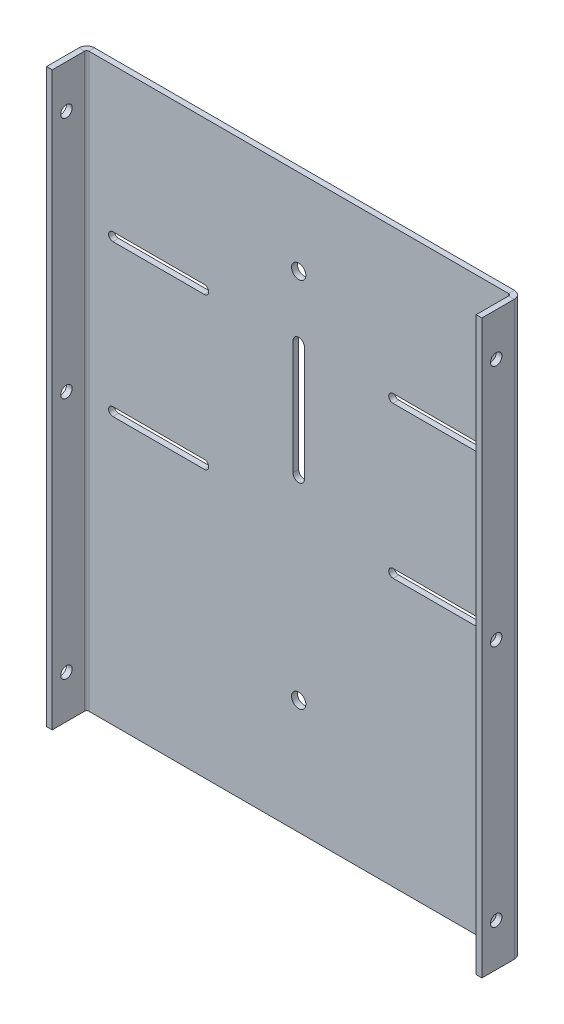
ISO-10303-21;
HEADER;
FILE_DESCRIPTION(('STEP AP214'),'2;1');
FILE_NAME('part.step','',(''),(''),'','','');
FILE_SCHEMA(('AUTOMOTIVE_DESIGN { 1 0 10303 214 1 1 1 1 }'));
ENDSEC;
DATA;
#1=APPLICATION_CONTEXT('core data for automotive mechanical design processes');
#2=APPLICATION_PROTOCOL_DEFINITION('international standard','automotive_design',2000,#1);
#3=PRODUCT_CONTEXT('',#1,'mechanical');
#4=PRODUCT('Part','Part','',(#3));
#5=PRODUCT_RELATED_PRODUCT_CATEGORY('part','',(#4));
#6=PRODUCT_DEFINITION_FORMATION('','',#4);
#7=PRODUCT_DEFINITION_CONTEXT('part definition',#1,'design');
#8=PRODUCT_DEFINITION('design','',#6,#7);
#9=PRODUCT_DEFINITION_SHAPE('','',#8);
#10=(LENGTH_UNIT() NAMED_UNIT(*) SI_UNIT(.MILLI.,.METRE.));
#11=(NAMED_UNIT(*) PLANE_ANGLE_UNIT() SI_UNIT($,.RADIAN.));
#12=(NAMED_UNIT(*) SI_UNIT($,.STERADIAN.) SOLID_ANGLE_UNIT());
#13=UNCERTAINTY_MEASURE_WITH_UNIT(LENGTH_MEASURE(1.E-05),#10,'distance_accuracy_value','');
#14=(GEOMETRIC_REPRESENTATION_CONTEXT(3) GLOBAL_UNCERTAINTY_ASSIGNED_CONTEXT((#13)) GLOBAL_UNIT_ASSIGNED_CONTEXT((#10,
#11,#12)) REPRESENTATION_CONTEXT('',''));
#15=CARTESIAN_POINT('',(0.,0.,0.));
#16=DIRECTION('',(0.,0.,1.));
#17=DIRECTION('',(1.,0.,0.));
#18=AXIS2_PLACEMENT_3D('',#15,#16,#17);
#19=CARTESIAN_POINT('',(-87.5,100.,2.));
#20=DIRECTION('',(0.,0.,1.));
#21=DIRECTION('',(1.,0.,0.));
#22=AXIS2_PLACEMENT_3D('',#19,#20,#21);
#23=PLANE('',#22);
#24=CARTESIAN_POINT('',(33.,-4.99999999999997,2.));
#25=DIRECTION('',(0.,0.,1.));
#26=DIRECTION('',(1.,0.,0.));
#27=AXIS2_PLACEMENT_3D('',#24,#25,#26);
#28=CIRCLE('',#27,1.5);
#29=CARTESIAN_POINT('',(33.,-3.49999999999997,2.));
#30=VERTEX_POINT('',#29);
#31=CARTESIAN_POINT('',(33.,-6.49999999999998,2.));
#32=VERTEX_POINT('',#31);
#33=EDGE_CURVE('E378',#30,#32,#28,.T.);
#34=ORIENTED_EDGE('',*,*,#33,.F.);
#35=DIRECTION('',(-1.,0.,0.));
#36=VECTOR('',#35,1.);
#37=CARTESIAN_POINT('',(33.,-3.49999999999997,2.));
#38=LINE('',#37,#36);
#39=CARTESIAN_POINT('',(65.,-3.49999999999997,2.));
#40=VERTEX_POINT('',#39);
#41=EDGE_CURVE('E386',#40,#30,#38,.T.);
#42=ORIENTED_EDGE('',*,*,#41,.F.);
#43=CARTESIAN_POINT('',(65.,-4.99999999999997,2.));
#44=DIRECTION('',(0.,0.,1.));
#45=DIRECTION('',(-1.,0.,0.));
#46=AXIS2_PLACEMENT_3D('',#43,#44,#45);
#47=CIRCLE('',#46,1.5);
#48=CARTESIAN_POINT('',(65.,-6.49999999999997,2.));
#49=VERTEX_POINT('',#48);
#50=EDGE_CURVE('E383',#49,#40,#47,.T.);
#51=ORIENTED_EDGE('',*,*,#50,.F.);
#52=DIRECTION('',(1.,0.,0.));
#53=VECTOR('',#52,1.);
#54=CARTESIAN_POINT('',(33.,-6.49999999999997,2.));
#55=LINE('',#54,#53);
#56=EDGE_CURVE('E380',#32,#49,#55,.T.);
#57=ORIENTED_EDGE('',*,*,#56,.F.);
#58=EDGE_LOOP('',(#34,#42,#51,#57));
#59=FACE_BOUND('',#58,.T.);
#60=CARTESIAN_POINT('',(33.,48.,2.));
#61=DIRECTION('',(0.,0.,1.));
#62=DIRECTION('',(1.,0.,0.));
#63=AXIS2_PLACEMENT_3D('',#60,#61,#62);
#64=CIRCLE('',#63,1.5);
#65=CARTESIAN_POINT('',(33.,49.5,2.));
#66=VERTEX_POINT('',#65);
#67=CARTESIAN_POINT('',(33.,46.5,2.));
#68=VERTEX_POINT('',#67);
#69=EDGE_CURVE('E404',#66,#68,#64,.T.);
#70=ORIENTED_EDGE('',*,*,#69,.F.);
#71=DIRECTION('',(-1.,0.,0.));
#72=VECTOR('',#71,1.);
#73=CARTESIAN_POINT('',(33.,49.5,2.));
#74=LINE('',#73,#72);
#75=CARTESIAN_POINT('',(65.,49.5,2.));
#76=VERTEX_POINT('',#75);
#77=EDGE_CURVE('E418',#76,#66,#74,.T.);
#78=ORIENTED_EDGE('',*,*,#77,.F.);
#79=CARTESIAN_POINT('',(65.,48.,2.));
#80=DIRECTION('',(0.,0.,1.));
#81=DIRECTION('',(-1.,0.,0.));
#82=AXIS2_PLACEMENT_3D('',#79,#80,#81);
#83=CIRCLE('',#82,1.5);
#84=CARTESIAN_POINT('',(65.,46.5,2.));
#85=VERTEX_POINT('',#84);
#86=EDGE_CURVE('E415',#85,#76,#83,.T.);
#87=ORIENTED_EDGE('',*,*,#86,.F.);
#88=DIRECTION('',(1.,0.,0.));
#89=VECTOR('',#88,1.);
#90=CARTESIAN_POINT('',(33.,46.5,2.));
#91=LINE('',#90,#89);
#92=EDGE_CURVE('E412',#68,#85,#91,.T.);
#93=ORIENTED_EDGE('',*,*,#92,.F.);
#94=EDGE_LOOP('',(#70,#78,#87,#93));
#95=FACE_BOUND('',#94,.T.);
#96=CARTESIAN_POINT('',(-65.,-4.99999999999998,2.));
#97=DIRECTION('',(0.,0.,1.));
#98=DIRECTION('',(1.,0.,0.));
#99=AXIS2_PLACEMENT_3D('',#96,#97,#98);
#100=CIRCLE('',#99,1.5);
#101=CARTESIAN_POINT('',(-65.,-3.49999999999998,2.));
#102=VERTEX_POINT('',#101);
#103=CARTESIAN_POINT('',(-65.,-6.49999999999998,2.));
#104=VERTEX_POINT('',#103);
#105=EDGE_CURVE('E436',#102,#104,#100,.T.);
#106=ORIENTED_EDGE('',*,*,#105,.F.);
#107=DIRECTION('',(-1.,0.,0.));
#108=VECTOR('',#107,1.);
#109=CARTESIAN_POINT('',(-65.,-3.49999999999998,2.));
#110=LINE('',#109,#108);
#111=CARTESIAN_POINT('',(-33.,-3.49999999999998,2.));
#112=VERTEX_POINT('',#111);
#113=EDGE_CURVE('E450',#112,#102,#110,.T.);
#114=ORIENTED_EDGE('',*,*,#113,.F.);
#115=CARTESIAN_POINT('',(-33.,-4.99999999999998,2.));
#116=DIRECTION('',(0.,0.,1.));
#117=DIRECTION('',(-1.,0.,0.));
#118=AXIS2_PLACEMENT_3D('',#115,#116,#117);
#119=CIRCLE('',#118,1.5);
#120=CARTESIAN_POINT('',(-33.,-6.49999999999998,2.));
#121=VERTEX_POINT('',#120);
#122=EDGE_CURVE('E447',#121,#112,#119,.T.);
#123=ORIENTED_EDGE('',*,*,#122,.F.);
#124=DIRECTION('',(1.,0.,0.));
#125=VECTOR('',#124,1.);
#126=CARTESIAN_POINT('',(-65.,-6.49999999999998,2.));
#127=LINE('',#126,#125);
#128=EDGE_CURVE('E444',#104,#121,#127,.T.);
#129=ORIENTED_EDGE('',*,*,#128,.F.);
#130=EDGE_LOOP('',(#106,#114,#123,#129));
#131=FACE_BOUND('',#130,.T.);
#132=CARTESIAN_POINT('',(-65.,48.,2.));
#133=DIRECTION('',(0.,0.,1.));
#134=DIRECTION('',(1.,0.,0.));
#135=AXIS2_PLACEMENT_3D('',#132,#133,#134);
#136=CIRCLE('',#135,1.5);
#137=CARTESIAN_POINT('',(-65.,49.5,2.));
#138=VERTEX_POINT('',#137);
#139=CARTESIAN_POINT('',(-65.,46.5,2.));
#140=VERTEX_POINT('',#139);
#141=EDGE_CURVE('E468',#138,#140,#136,.T.);
#142=ORIENTED_EDGE('',*,*,#141,.F.);
#143=DIRECTION('',(-1.,0.,0.));
#144=VECTOR('',#143,1.);
#145=CARTESIAN_POINT('',(-65.,49.5,2.));
#146=LINE('',#145,#144);
#147=CARTESIAN_POINT('',(-33.,49.5,2.));
#148=VERTEX_POINT('',#147);
#149=EDGE_CURVE('E482',#148,#138,#146,.T.);
#150=ORIENTED_EDGE('',*,*,#149,.F.);
#151=CARTESIAN_POINT('',(-33.,48.,2.));
#152=DIRECTION('',(0.,0.,1.));
#153=DIRECTION('',(-1.,0.,0.));
#154=AXIS2_PLACEMENT_3D('',#151,#152,#153);
#155=CIRCLE('',#154,1.5);
#156=CARTESIAN_POINT('',(-33.,46.5,2.));
#157=VERTEX_POINT('',#156);
#158=EDGE_CURVE('E479',#157,#148,#155,.T.);
#159=ORIENTED_EDGE('',*,*,#158,.F.);
#160=DIRECTION('',(1.,0.,0.));
#161=VECTOR('',#160,1.);
#162=CARTESIAN_POINT('',(-65.,46.5,2.));
#163=LINE('',#162,#161);
#164=EDGE_CURVE('E476',#140,#157,#163,.T.);
#165=ORIENTED_EDGE('',*,*,#164,.F.);
#166=EDGE_LOOP('',(#142,#150,#159,#165));
#167=FACE_BOUND('',#166,.T.);
#168=CARTESIAN_POINT('',(0.,48.,2.));
#169=DIRECTION('',(0.,0.,1.));
#170=DIRECTION('',(-1.,0.,0.));
#171=AXIS2_PLACEMENT_3D('',#168,#169,#170);
#172=CIRCLE('',#171,2.);
#173=CARTESIAN_POINT('',(2.,48.,2.));
#174=VERTEX_POINT('',#173);
#175=CARTESIAN_POINT('',(-2.00000000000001,48.,2.));
#176=VERTEX_POINT('',#175);
#177=EDGE_CURVE('E500',#174,#176,#172,.T.);
#178=ORIENTED_EDGE('',*,*,#177,.F.);
#179=DIRECTION('',(0.,1.,0.));
#180=VECTOR('',#179,1.);
#181=CARTESIAN_POINT('',(2.,48.,2.));
#182=LINE('',#181,#180);
#183=CARTESIAN_POINT('',(2.,8.00000000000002,2.));
#184=VERTEX_POINT('',#183);
#185=EDGE_CURVE('E514',#184,#174,#182,.T.);
#186=ORIENTED_EDGE('',*,*,#185,.F.);
#187=CARTESIAN_POINT('',(0.,8.00000000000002,2.));
#188=DIRECTION('',(0.,0.,1.));
#189=DIRECTION('',(1.,0.,0.));
#190=AXIS2_PLACEMENT_3D('',#187,#188,#189);
#191=CIRCLE('',#190,2.00000000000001);
#192=CARTESIAN_POINT('',(-2.,8.00000000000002,2.));
#193=VERTEX_POINT('',#192);
#194=EDGE_CURVE('E511',#193,#184,#191,.T.);
#195=ORIENTED_EDGE('',*,*,#194,.F.);
#196=DIRECTION('',(0.,-1.,0.));
#197=VECTOR('',#196,1.);
#198=CARTESIAN_POINT('',(-2.,48.,2.));
#199=LINE('',#198,#197);
#200=EDGE_CURVE('E508',#176,#193,#199,.T.);
#201=ORIENTED_EDGE('',*,*,#200,.F.);
#202=EDGE_LOOP('',(#178,#186,#195,#201));
#203=FACE_BOUND('',#202,.T.);
#204=CARTESIAN_POINT('',(0.,-60.,2.));
#205=DIRECTION('',(0.,0.,1.));
#206=DIRECTION('',(1.,0.,0.));
#207=AXIS2_PLACEMENT_3D('',#204,#205,#206);
#208=CIRCLE('',#207,2.5);
#209=CARTESIAN_POINT('',(2.50000000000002,-60.,2.));
#210=VERTEX_POINT('',#209);
#211=EDGE_CURVE('E532',#210,#210,#208,.T.);
#212=ORIENTED_EDGE('',*,*,#211,.F.);
#213=EDGE_LOOP('',(#212));
#214=FACE_BOUND('',#213,.T.);
#215=CARTESIAN_POINT('',(0.,70.,2.));
#216=DIRECTION('',(0.,0.,1.));
#217=DIRECTION('',(1.,0.,0.));
#218=AXIS2_PLACEMENT_3D('',#215,#216,#217);
#219=CIRCLE('',#218,2.5);
#220=CARTESIAN_POINT('',(2.50000000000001,70.,2.));
#221=VERTEX_POINT('',#220);
#222=EDGE_CURVE('E544',#221,#221,#219,.T.);
#223=ORIENTED_EDGE('',*,*,#222,.F.);
#224=EDGE_LOOP('',(#223));
#225=FACE_BOUND('',#224,.T.);
#226=DIRECTION('',(1.,0.,0.));
#227=VECTOR('',#226,1.);
#228=CARTESIAN_POINT('',(-87.5,-100.,2.));
#229=LINE('',#228,#227);
#230=CARTESIAN_POINT('',(-73.436077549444,-100.,1.99999997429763));
#231=VERTEX_POINT('',#230);
#232=CARTESIAN_POINT('',(73.436077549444,-100.,2.));
#233=VERTEX_POINT('',#232);
#234=EDGE_CURVE('E54',#231,#233,#229,.T.);
#235=ORIENTED_EDGE('',*,*,#234,.T.);
#236=DIRECTION('',(0.,1.,0.));
#237=VECTOR('',#236,1.);
#238=CARTESIAN_POINT('',(73.436077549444,100.,2.));
#239=LINE('',#238,#237);
#240=CARTESIAN_POINT('',(73.436077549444,100.,1.99999994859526));
#241=VERTEX_POINT('',#240);
#242=EDGE_CURVE('E560',#233,#241,#239,.T.);
#243=ORIENTED_EDGE('',*,*,#242,.T.);
#244=DIRECTION('',(-1.,0.,0.));
#245=VECTOR('',#244,1.);
#246=CARTESIAN_POINT('',(-87.5,100.,2.));
#247=LINE('',#246,#245);
#248=CARTESIAN_POINT('',(-73.436077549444,100.,1.99999994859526));
#249=VERTEX_POINT('',#248);
#250=EDGE_CURVE('E553',#241,#249,#247,.T.);
#251=ORIENTED_EDGE('',*,*,#250,.T.);
#252=DIRECTION('',(0.,1.,0.));
#253=VECTOR('',#252,1.);
#254=CARTESIAN_POINT('',(-73.436077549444,100.,2.));
#255=LINE('',#254,#253);
#256=EDGE_CURVE('E550',#231,#249,#255,.T.);
#257=ORIENTED_EDGE('',*,*,#256,.F.);
#258=EDGE_LOOP('',(#235,#243,#251,#257));
#259=FACE_BOUND('',#258,.T.);
#260=ADVANCED_FACE('F50',(#59,#95,#131,#167,#203,#214,#225,#259),#23,.T.);
#261=CARTESIAN_POINT('',(-87.5,100.,0.));
#262=DIRECTION('',(0.,0.,1.));
#263=DIRECTION('',(1.,0.,0.));
#264=AXIS2_PLACEMENT_3D('',#261,#262,#263);
#265=PLANE('',#264);
#266=DIRECTION('',(0.,1.,0.));
#267=VECTOR('',#266,1.);
#268=CARTESIAN_POINT('',(73.436077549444,100.,0.));
#269=LINE('',#268,#267);
#270=CARTESIAN_POINT('',(73.436077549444,-100.,0.));
#271=VERTEX_POINT('',#270);
#272=CARTESIAN_POINT('',(73.436077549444,100.,0.));
#273=VERTEX_POINT('',#272);
#274=EDGE_CURVE('E59',#271,#273,#269,.T.);
#275=ORIENTED_EDGE('',*,*,#274,.F.);
#276=DIRECTION('',(1.,0.,0.));
#277=VECTOR('',#276,1.);
#278=CARTESIAN_POINT('',(-87.5,-100.,0.));
#279=LINE('',#278,#277);
#280=CARTESIAN_POINT('',(-73.436077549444,-100.,0.));
#281=VERTEX_POINT('',#280);
#282=EDGE_CURVE('E75',#281,#271,#279,.T.);
#283=ORIENTED_EDGE('',*,*,#282,.F.);
#284=DIRECTION('',(0.,1.,0.));
#285=VECTOR('',#284,1.);
#286=CARTESIAN_POINT('',(-73.436077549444,100.,0.));
#287=LINE('',#286,#285);
#288=CARTESIAN_POINT('',(-73.436077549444,100.,-5.14047437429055E-08));
#289=VERTEX_POINT('',#288);
#290=EDGE_CURVE('E556',#281,#289,#287,.T.);
#291=ORIENTED_EDGE('',*,*,#290,.T.);
#292=DIRECTION('',(-1.,0.,0.));
#293=VECTOR('',#292,1.);
#294=CARTESIAN_POINT('',(-87.5,100.,0.));
#295=LINE('',#294,#293);
#296=EDGE_CURVE('E67',#273,#289,#295,.T.);
#297=ORIENTED_EDGE('',*,*,#296,.F.);
#298=EDGE_LOOP('',(#275,#283,#291,#297));
#299=FACE_BOUND('',#298,.T.);
#300=CARTESIAN_POINT('',(0.,70.,0.));
#301=DIRECTION('',(0.,0.,1.));
#302=DIRECTION('',(1.,0.,0.));
#303=AXIS2_PLACEMENT_3D('',#300,#301,#302);
#304=CIRCLE('',#303,2.5);
#305=CARTESIAN_POINT('',(2.50000000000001,70.,0.));
#306=VERTEX_POINT('',#305);
#307=EDGE_CURVE('E547',#306,#306,#304,.T.);
#308=ORIENTED_EDGE('',*,*,#307,.T.);
#309=EDGE_LOOP('',(#308));
#310=FACE_BOUND('',#309,.T.);
#311=CARTESIAN_POINT('',(0.,-60.,0.));
#312=DIRECTION('',(0.,0.,1.));
#313=DIRECTION('',(1.,0.,0.));
#314=AXIS2_PLACEMENT_3D('',#311,#312,#313);
#315=CIRCLE('',#314,2.5);
#316=CARTESIAN_POINT('',(2.50000000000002,-60.,0.));
#317=VERTEX_POINT('',#316);
#318=EDGE_CURVE('E541',#317,#317,#315,.T.);
#319=ORIENTED_EDGE('',*,*,#318,.T.);
#320=EDGE_LOOP('',(#319));
#321=FACE_BOUND('',#320,.T.);
#322=DIRECTION('',(0.,1.,0.));
#323=VECTOR('',#322,1.);
#324=CARTESIAN_POINT('',(2.,48.,0.));
#325=LINE('',#324,#323);
#326=CARTESIAN_POINT('',(2.,8.00000000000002,0.));
#327=VERTEX_POINT('',#326);
#328=CARTESIAN_POINT('',(2.,48.,0.));
#329=VERTEX_POINT('',#328);
#330=EDGE_CURVE('E526',#327,#329,#325,.T.);
#331=ORIENTED_EDGE('',*,*,#330,.T.);
#332=CARTESIAN_POINT('',(0.,48.,0.));
#333=DIRECTION('',(0.,0.,1.));
#334=DIRECTION('',(-1.,0.,0.));
#335=AXIS2_PLACEMENT_3D('',#332,#333,#334);
#336=CIRCLE('',#335,2.);
#337=CARTESIAN_POINT('',(-2.,48.,0.));
#338=VERTEX_POINT('',#337);
#339=EDGE_CURVE('E517',#329,#338,#336,.T.);
#340=ORIENTED_EDGE('',*,*,#339,.T.);
#341=DIRECTION('',(0.,-1.,0.));
#342=VECTOR('',#341,1.);
#343=CARTESIAN_POINT('',(-2.,48.,0.));
#344=LINE('',#343,#342);
#345=CARTESIAN_POINT('',(-2.,8.00000000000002,0.));
#346=VERTEX_POINT('',#345);
#347=EDGE_CURVE('E520',#338,#346,#344,.T.);
#348=ORIENTED_EDGE('',*,*,#347,.T.);
#349=CARTESIAN_POINT('',(0.,8.00000000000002,0.));
#350=DIRECTION('',(0.,0.,1.));
#351=DIRECTION('',(1.,0.,0.));
#352=AXIS2_PLACEMENT_3D('',#349,#350,#351);
#353=CIRCLE('',#352,2.00000000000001);
#354=EDGE_CURVE('E523',#346,#327,#353,.T.);
#355=ORIENTED_EDGE('',*,*,#354,.T.);
#356=EDGE_LOOP('',(#331,#340,#348,#355));
#357=FACE_BOUND('',#356,.T.);
#358=DIRECTION('',(-1.,0.,0.));
#359=VECTOR('',#358,1.);
#360=CARTESIAN_POINT('',(-65.,49.5,0.));
#361=LINE('',#360,#359);
#362=CARTESIAN_POINT('',(-33.,49.5,0.));
#363=VERTEX_POINT('',#362);
#364=CARTESIAN_POINT('',(-65.,49.5,0.));
#365=VERTEX_POINT('',#364);
#366=EDGE_CURVE('E494',#363,#365,#361,.T.);
#367=ORIENTED_EDGE('',*,*,#366,.T.);
#368=CARTESIAN_POINT('',(-65.,48.,0.));
#369=DIRECTION('',(0.,0.,1.));
#370=DIRECTION('',(1.,0.,0.));
#371=AXIS2_PLACEMENT_3D('',#368,#369,#370);
#372=CIRCLE('',#371,1.5);
#373=CARTESIAN_POINT('',(-65.,46.5,0.));
#374=VERTEX_POINT('',#373);
#375=EDGE_CURVE('E485',#365,#374,#372,.T.);
#376=ORIENTED_EDGE('',*,*,#375,.T.);
#377=DIRECTION('',(1.,0.,0.));
#378=VECTOR('',#377,1.);
#379=CARTESIAN_POINT('',(-65.,46.5,0.));
#380=LINE('',#379,#378);
#381=CARTESIAN_POINT('',(-33.,46.5,0.));
#382=VERTEX_POINT('',#381);
#383=EDGE_CURVE('E488',#374,#382,#380,.T.);
#384=ORIENTED_EDGE('',*,*,#383,.T.);
#385=CARTESIAN_POINT('',(-33.,48.,0.));
#386=DIRECTION('',(0.,0.,1.));
#387=DIRECTION('',(-1.,0.,0.));
#388=AXIS2_PLACEMENT_3D('',#385,#386,#387);
#389=CIRCLE('',#388,1.5);
#390=EDGE_CURVE('E491',#382,#363,#389,.T.);
#391=ORIENTED_EDGE('',*,*,#390,.T.);
#392=EDGE_LOOP('',(#367,#376,#384,#391));
#393=FACE_BOUND('',#392,.T.);
#394=DIRECTION('',(-1.,0.,0.));
#395=VECTOR('',#394,1.);
#396=CARTESIAN_POINT('',(-65.,-3.49999999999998,0.));
#397=LINE('',#396,#395);
#398=CARTESIAN_POINT('',(-33.,-3.49999999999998,0.));
#399=VERTEX_POINT('',#398);
#400=CARTESIAN_POINT('',(-65.,-3.49999999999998,0.));
#401=VERTEX_POINT('',#400);
#402=EDGE_CURVE('E462',#399,#401,#397,.T.);
#403=ORIENTED_EDGE('',*,*,#402,.T.);
#404=CARTESIAN_POINT('',(-65.,-4.99999999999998,0.));
#405=DIRECTION('',(0.,0.,1.));
#406=DIRECTION('',(1.,0.,0.));
#407=AXIS2_PLACEMENT_3D('',#404,#405,#406);
#408=CIRCLE('',#407,1.5);
#409=CARTESIAN_POINT('',(-65.,-6.49999999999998,0.));
#410=VERTEX_POINT('',#409);
#411=EDGE_CURVE('E453',#401,#410,#408,.T.);
#412=ORIENTED_EDGE('',*,*,#411,.T.);
#413=DIRECTION('',(1.,0.,0.));
#414=VECTOR('',#413,1.);
#415=CARTESIAN_POINT('',(-65.,-6.49999999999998,0.));
#416=LINE('',#415,#414);
#417=CARTESIAN_POINT('',(-33.,-6.49999999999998,0.));
#418=VERTEX_POINT('',#417);
#419=EDGE_CURVE('E456',#410,#418,#416,.T.);
#420=ORIENTED_EDGE('',*,*,#419,.T.);
#421=CARTESIAN_POINT('',(-33.,-4.99999999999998,0.));
#422=DIRECTION('',(0.,0.,1.));
#423=DIRECTION('',(-1.,0.,0.));
#424=AXIS2_PLACEMENT_3D('',#421,#422,#423);
#425=CIRCLE('',#424,1.5);
#426=EDGE_CURVE('E459',#418,#399,#425,.T.);
#427=ORIENTED_EDGE('',*,*,#426,.T.);
#428=EDGE_LOOP('',(#403,#412,#420,#427));
#429=FACE_BOUND('',#428,.T.);
#430=DIRECTION('',(-1.,0.,0.));
#431=VECTOR('',#430,1.);
#432=CARTESIAN_POINT('',(33.,49.5,0.));
#433=LINE('',#432,#431);
#434=CARTESIAN_POINT('',(65.,49.5,0.));
#435=VERTEX_POINT('',#434);
#436=CARTESIAN_POINT('',(33.,49.5,0.));
#437=VERTEX_POINT('',#436);
#438=EDGE_CURVE('E430',#435,#437,#433,.T.);
#439=ORIENTED_EDGE('',*,*,#438,.T.);
#440=CARTESIAN_POINT('',(33.,48.,0.));
#441=DIRECTION('',(0.,0.,1.));
#442=DIRECTION('',(1.,0.,0.));
#443=AXIS2_PLACEMENT_3D('',#440,#441,#442);
#444=CIRCLE('',#443,1.5);
#445=CARTESIAN_POINT('',(33.,46.5,0.));
#446=VERTEX_POINT('',#445);
#447=EDGE_CURVE('E421',#437,#446,#444,.T.);
#448=ORIENTED_EDGE('',*,*,#447,.T.);
#449=DIRECTION('',(1.,0.,0.));
#450=VECTOR('',#449,1.);
#451=CARTESIAN_POINT('',(33.,46.5,0.));
#452=LINE('',#451,#450);
#453=CARTESIAN_POINT('',(65.,46.5,0.));
#454=VERTEX_POINT('',#453);
#455=EDGE_CURVE('E424',#446,#454,#452,.T.);
#456=ORIENTED_EDGE('',*,*,#455,.T.);
#457=CARTESIAN_POINT('',(65.,48.,0.));
#458=DIRECTION('',(0.,0.,1.));
#459=DIRECTION('',(-1.,0.,0.));
#460=AXIS2_PLACEMENT_3D('',#457,#458,#459);
#461=CIRCLE('',#460,1.5);
#462=EDGE_CURVE('E427',#454,#435,#461,.T.);
#463=ORIENTED_EDGE('',*,*,#462,.T.);
#464=EDGE_LOOP('',(#439,#448,#456,#463));
#465=FACE_BOUND('',#464,.T.);
#466=DIRECTION('',(-1.,0.,0.));
#467=VECTOR('',#466,1.);
#468=CARTESIAN_POINT('',(33.,-3.49999999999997,0.));
#469=LINE('',#468,#467);
#470=CARTESIAN_POINT('',(65.,-3.49999999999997,0.));
#471=VERTEX_POINT('',#470);
#472=CARTESIAN_POINT('',(33.,-3.49999999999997,0.));
#473=VERTEX_POINT('',#472);
#474=EDGE_CURVE('E398',#471,#473,#469,.T.);
#475=ORIENTED_EDGE('',*,*,#474,.T.);
#476=CARTESIAN_POINT('',(33.,-4.99999999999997,0.));
#477=DIRECTION('',(0.,0.,1.));
#478=DIRECTION('',(1.,0.,0.));
#479=AXIS2_PLACEMENT_3D('',#476,#477,#478);
#480=CIRCLE('',#479,1.5);
#481=CARTESIAN_POINT('',(33.,-6.49999999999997,0.));
#482=VERTEX_POINT('',#481);
#483=EDGE_CURVE('E389',#473,#482,#480,.T.);
#484=ORIENTED_EDGE('',*,*,#483,.T.);
#485=DIRECTION('',(1.,0.,0.));
#486=VECTOR('',#485,1.);
#487=CARTESIAN_POINT('',(33.,-6.49999999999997,0.));
#488=LINE('',#487,#486);
#489=CARTESIAN_POINT('',(65.,-6.49999999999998,0.));
#490=VERTEX_POINT('',#489);
#491=EDGE_CURVE('E392',#482,#490,#488,.T.);
#492=ORIENTED_EDGE('',*,*,#491,.T.);
#493=CARTESIAN_POINT('',(65.,-4.99999999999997,0.));
#494=DIRECTION('',(0.,0.,1.));
#495=DIRECTION('',(-1.,0.,0.));
#496=AXIS2_PLACEMENT_3D('',#493,#494,#495);
#497=CIRCLE('',#496,1.5);
#498=EDGE_CURVE('E395',#490,#471,#497,.T.);
#499=ORIENTED_EDGE('',*,*,#498,.T.);
#500=EDGE_LOOP('',(#475,#484,#492,#499));
#501=FACE_BOUND('',#500,.T.);
#502=ADVANCED_FACE('F600',(#299,#310,#321,#357,#393,#429,#465,#501),#265,.F.);
#503=CARTESIAN_POINT('',(-87.5,100.,2.));
#504=DIRECTION('',(0.,-1.,0.));
#505=DIRECTION('',(1.,0.,0.));
#506=AXIS2_PLACEMENT_3D('',#503,#504,#505);
#507=PLANE('',#506);
#508=DIRECTION('',(0.,0.,1.));
#509=VECTOR('',#508,1.);
#510=CARTESIAN_POINT('',(73.436077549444,100.,2.));
#511=LINE('',#510,#509);
#512=EDGE_CURVE('E12',#273,#241,#511,.T.);
#513=ORIENTED_EDGE('',*,*,#512,.F.);
#514=ORIENTED_EDGE('',*,*,#296,.T.);
#515=DIRECTION('',(0.,0.,1.));
#516=VECTOR('',#515,1.);
#517=CARTESIAN_POINT('',(-73.436077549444,100.,2.));
#518=LINE('',#517,#516);
#519=EDGE_CURVE('E552',#289,#249,#518,.T.);
#520=ORIENTED_EDGE('',*,*,#519,.T.);
#521=ORIENTED_EDGE('',*,*,#250,.F.);
#522=EDGE_LOOP('',(#513,#514,#520,#521));
#523=FACE_BOUND('',#522,.T.);
#524=ADVANCED_FACE('F52',(#523),#507,.F.);
#525=CARTESIAN_POINT('',(-87.5,-100.,2.));
#526=DIRECTION('',(0.,1.,0.));
#527=DIRECTION('',(-1.,0.,0.));
#528=AXIS2_PLACEMENT_3D('',#525,#526,#527);
#529=PLANE('',#528);
#530=DIRECTION('',(0.,0.,-1.));
#531=VECTOR('',#530,1.);
#532=CARTESIAN_POINT('',(73.436077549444,-100.,2.));
#533=LINE('',#532,#531);
#534=EDGE_CURVE('E563',#233,#271,#533,.T.);
#535=ORIENTED_EDGE('',*,*,#534,.F.);
#536=ORIENTED_EDGE('',*,*,#234,.F.);
#537=DIRECTION('',(0.,0.,-1.));
#538=VECTOR('',#537,1.);
#539=CARTESIAN_POINT('',(-73.436077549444,-100.,2.));
#540=LINE('',#539,#538);
#541=EDGE_CURVE('E558',#231,#281,#540,.T.);
#542=ORIENTED_EDGE('',*,*,#541,.T.);
#543=ORIENTED_EDGE('',*,*,#282,.T.);
#544=EDGE_LOOP('',(#535,#536,#542,#543));
#545=FACE_BOUND('',#544,.T.);
#546=ADVANCED_FACE('F574',(#545),#529,.F.);
#547=CARTESIAN_POINT('',(0.,70.,0.));
#548=DIRECTION('',(0.,0.,1.));
#549=DIRECTION('',(1.,0.,0.));
#550=AXIS2_PLACEMENT_3D('',#547,#548,#549);
#551=CYLINDRICAL_SURFACE('',#550,2.5);
#552=ORIENTED_EDGE('',*,*,#307,.F.);
#553=EDGE_LOOP('',(#552));
#554=FACE_BOUND('',#553,.T.);
#555=ORIENTED_EDGE('',*,*,#222,.T.);
#556=EDGE_LOOP('',(#555));
#557=FACE_BOUND('',#556,.T.);
#558=ADVANCED_FACE('F657',(#554,#557),#551,.F.);
#559=CARTESIAN_POINT('',(0.,-60.,0.));
#560=DIRECTION('',(0.,0.,1.));
#561=DIRECTION('',(1.,0.,0.));
#562=AXIS2_PLACEMENT_3D('',#559,#560,#561);
#563=CYLINDRICAL_SURFACE('',#562,2.5);
#564=ORIENTED_EDGE('',*,*,#318,.F.);
#565=EDGE_LOOP('',(#564));
#566=FACE_BOUND('',#565,.T.);
#567=ORIENTED_EDGE('',*,*,#211,.T.);
#568=EDGE_LOOP('',(#567));
#569=FACE_BOUND('',#568,.T.);
#570=ADVANCED_FACE('F665',(#566,#569),#563,.F.);
#571=CARTESIAN_POINT('',(0.,48.,0.));
#572=DIRECTION('',(0.,0.,1.));
#573=DIRECTION('',(1.,0.,0.));
#574=AXIS2_PLACEMENT_3D('',#571,#572,#573);
#575=CYLINDRICAL_SURFACE('',#574,2.);
#576=ORIENTED_EDGE('',*,*,#177,.T.);
#577=DIRECTION('',(0.,0.,1.));
#578=VECTOR('',#577,1.);
#579=CARTESIAN_POINT('',(-2.,48.,0.));
#580=LINE('',#579,#578);
#581=EDGE_CURVE('E529',#338,#176,#580,.T.);
#582=ORIENTED_EDGE('',*,*,#581,.F.);
#583=ORIENTED_EDGE('',*,*,#339,.F.);
#584=DIRECTION('',(0.,0.,1.));
#585=VECTOR('',#584,1.);
#586=CARTESIAN_POINT('',(2.,48.,0.));
#587=LINE('',#586,#585);
#588=EDGE_CURVE('E530',#329,#174,#587,.T.);
#589=ORIENTED_EDGE('',*,*,#588,.T.);
#590=EDGE_LOOP('',(#576,#582,#583,#589));
#591=FACE_BOUND('',#590,.T.);
#592=ADVANCED_FACE('F1092',(#591),#575,.F.);
#593=CARTESIAN_POINT('',(2.,48.,0.));
#594=DIRECTION('',(1.,0.,0.));
#595=DIRECTION('',(0.,1.,0.));
#596=AXIS2_PLACEMENT_3D('',#593,#594,#595);
#597=PLANE('',#596);
#598=ORIENTED_EDGE('',*,*,#185,.T.);
#599=ORIENTED_EDGE('',*,*,#588,.F.);
#600=ORIENTED_EDGE('',*,*,#330,.F.);
#601=DIRECTION('',(0.,0.,1.));
#602=VECTOR('',#601,1.);
#603=CARTESIAN_POINT('',(2.,8.00000000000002,0.));
#604=LINE('',#603,#602);
#605=EDGE_CURVE('E533',#327,#184,#604,.T.);
#606=ORIENTED_EDGE('',*,*,#605,.T.);
#607=EDGE_LOOP('',(#598,#599,#600,#606));
#608=FACE_BOUND('',#607,.T.);
#609=ADVANCED_FACE('F1082',(#608),#597,.F.);
#610=CARTESIAN_POINT('',(0.,8.00000000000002,0.));
#611=DIRECTION('',(0.,0.,1.));
#612=DIRECTION('',(1.,0.,0.));
#613=AXIS2_PLACEMENT_3D('',#610,#611,#612);
#614=CYLINDRICAL_SURFACE('',#613,2.00000000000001);
#615=ORIENTED_EDGE('',*,*,#194,.T.);
#616=ORIENTED_EDGE('',*,*,#605,.F.);
#617=ORIENTED_EDGE('',*,*,#354,.F.);
#618=DIRECTION('',(0.,0.,1.));
#619=VECTOR('',#618,1.);
#620=CARTESIAN_POINT('',(-2.,8.00000000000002,0.));
#621=LINE('',#620,#619);
#622=EDGE_CURVE('E535',#346,#193,#621,.T.);
#623=ORIENTED_EDGE('',*,*,#622,.T.);
#624=EDGE_LOOP('',(#615,#616,#617,#623));
#625=FACE_BOUND('',#624,.T.);
#626=ADVANCED_FACE('F1072',(#625),#614,.F.);
#627=CARTESIAN_POINT('',(-2.,48.,0.));
#628=DIRECTION('',(-1.,0.,0.));
#629=DIRECTION('',(0.,-1.,0.));
#630=AXIS2_PLACEMENT_3D('',#627,#628,#629);
#631=PLANE('',#630);
#632=ORIENTED_EDGE('',*,*,#200,.T.);
#633=ORIENTED_EDGE('',*,*,#622,.F.);
#634=ORIENTED_EDGE('',*,*,#347,.F.);
#635=ORIENTED_EDGE('',*,*,#581,.T.);
#636=EDGE_LOOP('',(#632,#633,#634,#635));
#637=FACE_BOUND('',#636,.T.);
#638=ADVANCED_FACE('F1062',(#637),#631,.F.);
#639=CARTESIAN_POINT('',(-65.,48.,0.));
#640=DIRECTION('',(0.,0.,1.));
#641=DIRECTION('',(1.,0.,0.));
#642=AXIS2_PLACEMENT_3D('',#639,#640,#641);
#643=CYLINDRICAL_SURFACE('',#642,1.5);
#644=ORIENTED_EDGE('',*,*,#141,.T.);
#645=DIRECTION('',(0.,0.,1.));
#646=VECTOR('',#645,1.);
#647=CARTESIAN_POINT('',(-65.,46.5,0.));
#648=LINE('',#647,#646);
#649=EDGE_CURVE('E497',#374,#140,#648,.T.);
#650=ORIENTED_EDGE('',*,*,#649,.F.);
#651=ORIENTED_EDGE('',*,*,#375,.F.);
#652=DIRECTION('',(0.,0.,1.));
#653=VECTOR('',#652,1.);
#654=CARTESIAN_POINT('',(-65.,49.5,0.));
#655=LINE('',#654,#653);
#656=EDGE_CURVE('E498',#365,#138,#655,.T.);
#657=ORIENTED_EDGE('',*,*,#656,.T.);
#658=EDGE_LOOP('',(#644,#650,#651,#657));
#659=FACE_BOUND('',#658,.T.);
#660=ADVANCED_FACE('F1052',(#659),#643,.F.);
#661=CARTESIAN_POINT('',(-65.,49.5,0.));
#662=DIRECTION('',(0.,1.,0.));
#663=DIRECTION('',(0.,0.,1.));
#664=AXIS2_PLACEMENT_3D('',#661,#662,#663);
#665=PLANE('',#664);
#666=ORIENTED_EDGE('',*,*,#149,.T.);
#667=ORIENTED_EDGE('',*,*,#656,.F.);
#668=ORIENTED_EDGE('',*,*,#366,.F.);
#669=DIRECTION('',(0.,0.,1.));
#670=VECTOR('',#669,1.);
#671=CARTESIAN_POINT('',(-33.,49.5,0.));
#672=LINE('',#671,#670);
#673=EDGE_CURVE('E501',#363,#148,#672,.T.);
#674=ORIENTED_EDGE('',*,*,#673,.T.);
#675=EDGE_LOOP('',(#666,#667,#668,#674));
#676=FACE_BOUND('',#675,.T.);
#677=ADVANCED_FACE('F1042',(#676),#665,.F.);
#678=CARTESIAN_POINT('',(-33.,48.,0.));
#679=DIRECTION('',(0.,0.,1.));
#680=DIRECTION('',(1.,0.,0.));
#681=AXIS2_PLACEMENT_3D('',#678,#679,#680);
#682=CYLINDRICAL_SURFACE('',#681,1.5);
#683=ORIENTED_EDGE('',*,*,#158,.T.);
#684=ORIENTED_EDGE('',*,*,#673,.F.);
#685=ORIENTED_EDGE('',*,*,#390,.F.);
#686=DIRECTION('',(0.,0.,1.));
#687=VECTOR('',#686,1.);
#688=CARTESIAN_POINT('',(-33.,46.5,0.));
#689=LINE('',#688,#687);
#690=EDGE_CURVE('E503',#382,#157,#689,.T.);
#691=ORIENTED_EDGE('',*,*,#690,.T.);
#692=EDGE_LOOP('',(#683,#684,#685,#691));
#693=FACE_BOUND('',#692,.T.);
#694=ADVANCED_FACE('F1032',(#693),#682,.F.);
#695=CARTESIAN_POINT('',(-65.,46.5,0.));
#696=DIRECTION('',(0.,-1.,0.));
#697=DIRECTION('',(0.,0.,-1.));
#698=AXIS2_PLACEMENT_3D('',#695,#696,#697);
#699=PLANE('',#698);
#700=ORIENTED_EDGE('',*,*,#164,.T.);
#701=ORIENTED_EDGE('',*,*,#690,.F.);
#702=ORIENTED_EDGE('',*,*,#383,.F.);
#703=ORIENTED_EDGE('',*,*,#649,.T.);
#704=EDGE_LOOP('',(#700,#701,#702,#703));
#705=FACE_BOUND('',#704,.T.);
#706=ADVANCED_FACE('F1022',(#705),#699,.F.);
#707=CARTESIAN_POINT('',(-65.,-4.99999999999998,0.));
#708=DIRECTION('',(0.,0.,1.));
#709=DIRECTION('',(1.,0.,0.));
#710=AXIS2_PLACEMENT_3D('',#707,#708,#709);
#711=CYLINDRICAL_SURFACE('',#710,1.5);
#712=ORIENTED_EDGE('',*,*,#105,.T.);
#713=DIRECTION('',(0.,0.,1.));
#714=VECTOR('',#713,1.);
#715=CARTESIAN_POINT('',(-65.,-6.49999999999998,0.));
#716=LINE('',#715,#714);
#717=EDGE_CURVE('E465',#410,#104,#716,.T.);
#718=ORIENTED_EDGE('',*,*,#717,.F.);
#719=ORIENTED_EDGE('',*,*,#411,.F.);
#720=DIRECTION('',(0.,0.,1.));
#721=VECTOR('',#720,1.);
#722=CARTESIAN_POINT('',(-65.,-3.49999999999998,0.));
#723=LINE('',#722,#721);
#724=EDGE_CURVE('E466',#401,#102,#723,.T.);
#725=ORIENTED_EDGE('',*,*,#724,.T.);
#726=EDGE_LOOP('',(#712,#718,#719,#725));
#727=FACE_BOUND('',#726,.T.);
#728=ADVANCED_FACE('F1012',(#727),#711,.F.);
#729=CARTESIAN_POINT('',(-65.,-3.49999999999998,0.));
#730=DIRECTION('',(0.,1.,0.));
#731=DIRECTION('',(0.,0.,1.));
#732=AXIS2_PLACEMENT_3D('',#729,#730,#731);
#733=PLANE('',#732);
#734=ORIENTED_EDGE('',*,*,#113,.T.);
#735=ORIENTED_EDGE('',*,*,#724,.F.);
#736=ORIENTED_EDGE('',*,*,#402,.F.);
#737=DIRECTION('',(0.,0.,1.));
#738=VECTOR('',#737,1.);
#739=CARTESIAN_POINT('',(-33.,-3.49999999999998,0.));
#740=LINE('',#739,#738);
#741=EDGE_CURVE('E469',#399,#112,#740,.T.);
#742=ORIENTED_EDGE('',*,*,#741,.T.);
#743=EDGE_LOOP('',(#734,#735,#736,#742));
#744=FACE_BOUND('',#743,.T.);
#745=ADVANCED_FACE('F1002',(#744),#733,.F.);
#746=CARTESIAN_POINT('',(-33.,-4.99999999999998,0.));
#747=DIRECTION('',(0.,0.,1.));
#748=DIRECTION('',(1.,0.,0.));
#749=AXIS2_PLACEMENT_3D('',#746,#747,#748);
#750=CYLINDRICAL_SURFACE('',#749,1.5);
#751=ORIENTED_EDGE('',*,*,#122,.T.);
#752=ORIENTED_EDGE('',*,*,#741,.F.);
#753=ORIENTED_EDGE('',*,*,#426,.F.);
#754=DIRECTION('',(0.,0.,1.));
#755=VECTOR('',#754,1.);
#756=CARTESIAN_POINT('',(-33.,-6.49999999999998,0.));
#757=LINE('',#756,#755);
#758=EDGE_CURVE('E471',#418,#121,#757,.T.);
#759=ORIENTED_EDGE('',*,*,#758,.T.);
#760=EDGE_LOOP('',(#751,#752,#753,#759));
#761=FACE_BOUND('',#760,.T.);
#762=ADVANCED_FACE('F992',(#761),#750,.F.);
#763=CARTESIAN_POINT('',(-65.,-6.49999999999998,0.));
#764=DIRECTION('',(0.,-1.,0.));
#765=DIRECTION('',(0.,0.,-1.));
#766=AXIS2_PLACEMENT_3D('',#763,#764,#765);
#767=PLANE('',#766);
#768=ORIENTED_EDGE('',*,*,#128,.T.);
#769=ORIENTED_EDGE('',*,*,#758,.F.);
#770=ORIENTED_EDGE('',*,*,#419,.F.);
#771=ORIENTED_EDGE('',*,*,#717,.T.);
#772=EDGE_LOOP('',(#768,#769,#770,#771));
#773=FACE_BOUND('',#772,.T.);
#774=ADVANCED_FACE('F982',(#773),#767,.F.);
#775=CARTESIAN_POINT('',(33.,48.,0.));
#776=DIRECTION('',(0.,0.,1.));
#777=DIRECTION('',(1.,0.,0.));
#778=AXIS2_PLACEMENT_3D('',#775,#776,#777);
#779=CYLINDRICAL_SURFACE('',#778,1.5);
#780=ORIENTED_EDGE('',*,*,#69,.T.);
#781=DIRECTION('',(0.,0.,1.));
#782=VECTOR('',#781,1.);
#783=CARTESIAN_POINT('',(33.,46.5,0.));
#784=LINE('',#783,#782);
#785=EDGE_CURVE('E433',#446,#68,#784,.T.);
#786=ORIENTED_EDGE('',*,*,#785,.F.);
#787=ORIENTED_EDGE('',*,*,#447,.F.);
#788=DIRECTION('',(0.,0.,1.));
#789=VECTOR('',#788,1.);
#790=CARTESIAN_POINT('',(33.,49.5,0.));
#791=LINE('',#790,#789);
#792=EDGE_CURVE('E434',#437,#66,#791,.T.);
#793=ORIENTED_EDGE('',*,*,#792,.T.);
#794=EDGE_LOOP('',(#780,#786,#787,#793));
#795=FACE_BOUND('',#794,.T.);
#796=ADVANCED_FACE('F972',(#795),#779,.F.);
#797=CARTESIAN_POINT('',(33.,49.5,0.));
#798=DIRECTION('',(0.,1.,0.));
#799=DIRECTION('',(0.,0.,1.));
#800=AXIS2_PLACEMENT_3D('',#797,#798,#799);
#801=PLANE('',#800);
#802=ORIENTED_EDGE('',*,*,#77,.T.);
#803=ORIENTED_EDGE('',*,*,#792,.F.);
#804=ORIENTED_EDGE('',*,*,#438,.F.);
#805=DIRECTION('',(0.,0.,1.));
#806=VECTOR('',#805,1.);
#807=CARTESIAN_POINT('',(65.,49.5,0.));
#808=LINE('',#807,#806);
#809=EDGE_CURVE('E437',#435,#76,#808,.T.);
#810=ORIENTED_EDGE('',*,*,#809,.T.);
#811=EDGE_LOOP('',(#802,#803,#804,#810));
#812=FACE_BOUND('',#811,.T.);
#813=ADVANCED_FACE('F962',(#812),#801,.F.);
#814=CARTESIAN_POINT('',(65.,48.,0.));
#815=DIRECTION('',(0.,0.,1.));
#816=DIRECTION('',(1.,0.,0.));
#817=AXIS2_PLACEMENT_3D('',#814,#815,#816);
#818=CYLINDRICAL_SURFACE('',#817,1.5);
#819=ORIENTED_EDGE('',*,*,#86,.T.);
#820=ORIENTED_EDGE('',*,*,#809,.F.);
#821=ORIENTED_EDGE('',*,*,#462,.F.);
#822=DIRECTION('',(0.,0.,1.));
#823=VECTOR('',#822,1.);
#824=CARTESIAN_POINT('',(65.,46.5,0.));
#825=LINE('',#824,#823);
#826=EDGE_CURVE('E439',#454,#85,#825,.T.);
#827=ORIENTED_EDGE('',*,*,#826,.T.);
#828=EDGE_LOOP('',(#819,#820,#821,#827));
#829=FACE_BOUND('',#828,.T.);
#830=ADVANCED_FACE('F952',(#829),#818,.F.);
#831=CARTESIAN_POINT('',(33.,46.5,0.));
#832=DIRECTION('',(0.,-1.,0.));
#833=DIRECTION('',(0.,0.,-1.));
#834=AXIS2_PLACEMENT_3D('',#831,#832,#833);
#835=PLANE('',#834);
#836=ORIENTED_EDGE('',*,*,#92,.T.);
#837=ORIENTED_EDGE('',*,*,#826,.F.);
#838=ORIENTED_EDGE('',*,*,#455,.F.);
#839=ORIENTED_EDGE('',*,*,#785,.T.);
#840=EDGE_LOOP('',(#836,#837,#838,#839));
#841=FACE_BOUND('',#840,.T.);
#842=ADVANCED_FACE('F942',(#841),#835,.F.);
#843=CARTESIAN_POINT('',(33.,-4.99999999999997,0.));
#844=DIRECTION('',(0.,0.,1.));
#845=DIRECTION('',(1.,0.,0.));
#846=AXIS2_PLACEMENT_3D('',#843,#844,#845);
#847=CYLINDRICAL_SURFACE('',#846,1.5);
#848=ORIENTED_EDGE('',*,*,#33,.T.);
#849=DIRECTION('',(0.,0.,1.));
#850=VECTOR('',#849,1.);
#851=CARTESIAN_POINT('',(33.,-6.49999999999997,0.));
#852=LINE('',#851,#850);
#853=EDGE_CURVE('E401',#482,#32,#852,.T.);
#854=ORIENTED_EDGE('',*,*,#853,.F.);
#855=ORIENTED_EDGE('',*,*,#483,.F.);
#856=DIRECTION('',(0.,0.,1.));
#857=VECTOR('',#856,1.);
#858=CARTESIAN_POINT('',(33.,-3.49999999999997,0.));
#859=LINE('',#858,#857);
#860=EDGE_CURVE('E402',#473,#30,#859,.T.);
#861=ORIENTED_EDGE('',*,*,#860,.T.);
#862=EDGE_LOOP('',(#848,#854,#855,#861));
#863=FACE_BOUND('',#862,.T.);
#864=ADVANCED_FACE('F932',(#863),#847,.F.);
#865=CARTESIAN_POINT('',(33.,-3.49999999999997,0.));
#866=DIRECTION('',(0.,1.,0.));
#867=DIRECTION('',(0.,0.,1.));
#868=AXIS2_PLACEMENT_3D('',#865,#866,#867);
#869=PLANE('',#868);
#870=ORIENTED_EDGE('',*,*,#41,.T.);
#871=ORIENTED_EDGE('',*,*,#860,.F.);
#872=ORIENTED_EDGE('',*,*,#474,.F.);
#873=DIRECTION('',(0.,0.,1.));
#874=VECTOR('',#873,1.);
#875=CARTESIAN_POINT('',(65.,-3.49999999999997,0.));
#876=LINE('',#875,#874);
#877=EDGE_CURVE('E405',#471,#40,#876,.T.);
#878=ORIENTED_EDGE('',*,*,#877,.T.);
#879=EDGE_LOOP('',(#870,#871,#872,#878));
#880=FACE_BOUND('',#879,.T.);
#881=ADVANCED_FACE('F922',(#880),#869,.F.);
#882=CARTESIAN_POINT('',(65.,-4.99999999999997,0.));
#883=DIRECTION('',(0.,0.,1.));
#884=DIRECTION('',(1.,0.,0.));
#885=AXIS2_PLACEMENT_3D('',#882,#883,#884);
#886=CYLINDRICAL_SURFACE('',#885,1.5);
#887=ORIENTED_EDGE('',*,*,#50,.T.);
#888=ORIENTED_EDGE('',*,*,#877,.F.);
#889=ORIENTED_EDGE('',*,*,#498,.F.);
#890=DIRECTION('',(0.,0.,1.));
#891=VECTOR('',#890,1.);
#892=CARTESIAN_POINT('',(65.,-6.49999999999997,0.));
#893=LINE('',#892,#891);
#894=EDGE_CURVE('E407',#490,#49,#893,.T.);
#895=ORIENTED_EDGE('',*,*,#894,.T.);
#896=EDGE_LOOP('',(#887,#888,#889,#895));
#897=FACE_BOUND('',#896,.T.);
#898=ADVANCED_FACE('F912',(#897),#886,.F.);
#899=CARTESIAN_POINT('',(33.,-6.49999999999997,0.));
#900=DIRECTION('',(0.,-1.,0.));
#901=DIRECTION('',(0.,0.,-1.));
#902=AXIS2_PLACEMENT_3D('',#899,#900,#901);
#903=PLANE('',#902);
#904=ORIENTED_EDGE('',*,*,#56,.T.);
#905=ORIENTED_EDGE('',*,*,#894,.F.);
#906=ORIENTED_EDGE('',*,*,#491,.F.);
#907=ORIENTED_EDGE('',*,*,#853,.T.);
#908=EDGE_LOOP('',(#904,#905,#906,#907));
#909=FACE_BOUND('',#908,.T.);
#910=ADVANCED_FACE('F690',(#909),#903,.F.);
#911=CARTESIAN_POINT('',(-73.436077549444,-100.,2.73660005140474));
#912=DIRECTION('',(0.,1.,0.));
#913=DIRECTION('',(0.,0.,1.));
#914=AXIS2_PLACEMENT_3D('',#911,#912,#913);
#915=PLANE('',#914);
#916=DIRECTION('',(-1.,0.,0.));
#917=VECTOR('',#916,1.);
#918=CARTESIAN_POINT('',(-74.172677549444,-100.,2.73660000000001));
#919=LINE('',#918,#917);
#920=CARTESIAN_POINT('',(-74.1726776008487,-100.,2.73659999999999));
#921=VERTEX_POINT('',#920);
#922=CARTESIAN_POINT('',(-76.172677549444,-100.,2.73660000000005));
#923=VERTEX_POINT('',#922);
#924=EDGE_CURVE('E317',#921,#923,#919,.T.);
#925=ORIENTED_EDGE('',*,*,#924,.T.);
#926=CARTESIAN_POINT('',(-73.436077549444,-100.,2.7366));
#927=DIRECTION('',(0.,-1.,0.));
#928=DIRECTION('',(1.,0.,0.));
#929=AXIS2_PLACEMENT_3D('',#926,#927,#928);
#930=CIRCLE('',#929,2.73660005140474);
#931=EDGE_CURVE('E320',#923,#281,#930,.T.);
#932=ORIENTED_EDGE('',*,*,#931,.T.);
#933=ORIENTED_EDGE('',*,*,#541,.F.);
#934=CARTESIAN_POINT('',(-73.436077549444,-100.,2.73660005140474));
#935=DIRECTION('',(0.,-1.,0.));
#936=DIRECTION('',(0.,0.,-1.));
#937=AXIS2_PLACEMENT_3D('',#934,#935,#936);
#938=CIRCLE('',#937,0.736600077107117);
#939=EDGE_CURVE('E372',#921,#231,#938,.T.);
#940=ORIENTED_EDGE('',*,*,#939,.F.);
#941=EDGE_LOOP('',(#925,#932,#933,#940));
#942=FACE_BOUND('',#941,.T.);
#943=ADVANCED_FACE('F605',(#942),#915,.F.);
#944=CARTESIAN_POINT('',(-73.436077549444,100.,2.73660005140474));
#945=DIRECTION('',(0.,-1.,0.));
#946=DIRECTION('',(0.,0.,-1.));
#947=AXIS2_PLACEMENT_3D('',#944,#945,#946);
#948=PLANE('',#947);
#949=CARTESIAN_POINT('',(-73.436077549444,100.,2.7366));
#950=DIRECTION('',(0.,-1.,0.));
#951=DIRECTION('',(1.,0.,0.));
#952=AXIS2_PLACEMENT_3D('',#949,#950,#951);
#953=CIRCLE('',#952,2.73660005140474);
#954=CARTESIAN_POINT('',(-76.172677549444,100.,2.73659999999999));
#955=VERTEX_POINT('',#954);
#956=EDGE_CURVE('E369',#289,#955,#953,.F.);
#957=ORIENTED_EDGE('',*,*,#956,.T.);
#958=DIRECTION('',(1.,0.,0.));
#959=VECTOR('',#958,1.);
#960=CARTESIAN_POINT('',(-74.172677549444,100.,2.73660000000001));
#961=LINE('',#960,#959);
#962=CARTESIAN_POINT('',(-74.172677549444,100.,2.73660000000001));
#963=VERTEX_POINT('',#962);
#964=EDGE_CURVE('E360',#955,#963,#961,.T.);
#965=ORIENTED_EDGE('',*,*,#964,.T.);
#966=CARTESIAN_POINT('',(-73.436077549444,100.,2.73660005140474));
#967=DIRECTION('',(0.,1.,0.));
#968=DIRECTION('',(0.,0.,1.));
#969=AXIS2_PLACEMENT_3D('',#966,#967,#968);
#970=CIRCLE('',#969,0.73660007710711);
#971=EDGE_CURVE('E375',#249,#963,#970,.T.);
#972=ORIENTED_EDGE('',*,*,#971,.F.);
#973=ORIENTED_EDGE('',*,*,#519,.F.);
#974=EDGE_LOOP('',(#957,#965,#972,#973));
#975=FACE_BOUND('',#974,.T.);
#976=ADVANCED_FACE('F620',(#975),#948,.F.);
#977=CARTESIAN_POINT('',(-73.436077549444,200.028600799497,2.7366));
#978=DIRECTION('',(0.,-1.,0.));
#979=DIRECTION('',(1.,0.,0.));
#980=AXIS2_PLACEMENT_3D('',#977,#978,#979);
#981=CYLINDRICAL_SURFACE('',#980,0.736600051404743);
#982=ORIENTED_EDGE('',*,*,#256,.T.);
#983=ORIENTED_EDGE('',*,*,#971,.T.);
#984=DIRECTION('',(0.,1.,0.));
#985=VECTOR('',#984,1.);
#986=CARTESIAN_POINT('',(-74.172677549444,100.,2.73660000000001));
#987=LINE('',#986,#985);
#988=EDGE_CURVE('E340',#921,#963,#987,.T.);
#989=ORIENTED_EDGE('',*,*,#988,.F.);
#990=ORIENTED_EDGE('',*,*,#939,.T.);
#991=EDGE_LOOP('',(#982,#983,#989,#990));
#992=FACE_BOUND('',#991,.T.);
#993=ADVANCED_FACE('F609',(#992),#981,.F.);
#994=CARTESIAN_POINT('',(-73.436077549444,200.028600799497,2.7366));
#995=DIRECTION('',(0.,-1.,0.));
#996=DIRECTION('',(1.,0.,0.));
#997=AXIS2_PLACEMENT_3D('',#994,#995,#996);
#998=CYLINDRICAL_SURFACE('',#997,2.73660005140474);
#999=ORIENTED_EDGE('',*,*,#290,.F.);
#1000=ORIENTED_EDGE('',*,*,#931,.F.);
#1001=DIRECTION('',(0.,1.,0.));
#1002=VECTOR('',#1001,1.);
#1003=CARTESIAN_POINT('',(-76.172677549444,100.,2.73660000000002));
#1004=LINE('',#1003,#1002);
#1005=EDGE_CURVE('E363',#923,#955,#1004,.T.);
#1006=ORIENTED_EDGE('',*,*,#1005,.T.);
#1007=ORIENTED_EDGE('',*,*,#956,.F.);
#1008=EDGE_LOOP('',(#999,#1000,#1006,#1007));
#1009=FACE_BOUND('',#1008,.T.);
#1010=ADVANCED_FACE('F623',(#1009),#998,.T.);
#1011=CARTESIAN_POINT('',(-74.172677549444,100.,14.072677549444));
#1012=DIRECTION('',(0.,0.,-1.));
#1013=DIRECTION('',(-1.,0.,0.));
#1014=AXIS2_PLACEMENT_3D('',#1011,#1012,#1013);
#1015=PLANE('',#1014);
#1016=DIRECTION('',(0.,-1.,0.));
#1017=VECTOR('',#1016,1.);
#1018=CARTESIAN_POINT('',(-76.172677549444,100.,14.072677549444));
#1019=LINE('',#1018,#1017);
#1020=CARTESIAN_POINT('',(-76.172677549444,100.,14.072677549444));
#1021=VERTEX_POINT('',#1020);
#1022=CARTESIAN_POINT('',(-76.1726775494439,-100.,14.072677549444));
#1023=VERTEX_POINT('',#1022);
#1024=EDGE_CURVE('E357',#1021,#1023,#1019,.T.);
#1025=ORIENTED_EDGE('',*,*,#1024,.T.);
#1026=DIRECTION('',(-1.,0.,0.));
#1027=VECTOR('',#1026,1.);
#1028=CARTESIAN_POINT('',(-74.1726775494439,-100.,14.072677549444));
#1029=LINE('',#1028,#1027);
#1030=CARTESIAN_POINT('',(-74.1726775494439,-100.,14.072677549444));
#1031=VERTEX_POINT('',#1030);
#1032=EDGE_CURVE('E321',#1031,#1023,#1029,.T.);
#1033=ORIENTED_EDGE('',*,*,#1032,.F.);
#1034=DIRECTION('',(0.,-1.,0.));
#1035=VECTOR('',#1034,1.);
#1036=CARTESIAN_POINT('',(-74.172677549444,100.,14.072677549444));
#1037=LINE('',#1036,#1035);
#1038=CARTESIAN_POINT('',(-74.172677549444,100.,14.072677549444));
#1039=VERTEX_POINT('',#1038);
#1040=EDGE_CURVE('E335',#1039,#1031,#1037,.T.);
#1041=ORIENTED_EDGE('',*,*,#1040,.F.);
#1042=DIRECTION('',(-1.,0.,0.));
#1043=VECTOR('',#1042,1.);
#1044=CARTESIAN_POINT('',(-74.172677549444,100.,14.072677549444));
#1045=LINE('',#1044,#1043);
#1046=EDGE_CURVE('E354',#1039,#1021,#1045,.T.);
#1047=ORIENTED_EDGE('',*,*,#1046,.T.);
#1048=EDGE_LOOP('',(#1025,#1033,#1041,#1047));
#1049=FACE_BOUND('',#1048,.T.);
#1050=ADVANCED_FACE('F633',(#1049),#1015,.F.);
#1051=CARTESIAN_POINT('',(-76.1726775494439,-85.,9.07267754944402));
#1052=DIRECTION('',(1.,0.,0.));
#1053=DIRECTION('',(0.,0.,-1.));
#1054=AXIS2_PLACEMENT_3D('',#1051,#1052,#1053);
#1055=CYLINDRICAL_SURFACE('',#1054,2.);
#1056=CARTESIAN_POINT('',(-76.1726775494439,-85.,9.07267754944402));
#1057=DIRECTION('',(1.,0.,0.));
#1058=DIRECTION('',(0.,0.,-1.));
#1059=AXIS2_PLACEMENT_3D('',#1056,#1057,#1058);
#1060=CIRCLE('',#1059,2.);
#1061=CARTESIAN_POINT('',(-76.172677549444,-85.,7.07267754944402));
#1062=VERTEX_POINT('',#1061);
#1063=EDGE_CURVE('E324',#1062,#1062,#1060,.T.);
#1064=ORIENTED_EDGE('',*,*,#1063,.F.);
#1065=EDGE_LOOP('',(#1064));
#1066=FACE_BOUND('',#1065,.T.);
#1067=CARTESIAN_POINT('',(-74.1726775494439,-85.,9.07267754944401));
#1068=DIRECTION('',(1.,0.,0.));
#1069=DIRECTION('',(0.,0.,-1.));
#1070=AXIS2_PLACEMENT_3D('',#1067,#1068,#1069);
#1071=CIRCLE('',#1070,2.);
#1072=CARTESIAN_POINT('',(-74.172677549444,-85.,7.07267754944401));
#1073=VERTEX_POINT('',#1072);
#1074=EDGE_CURVE('E351',#1073,#1073,#1071,.T.);
#1075=ORIENTED_EDGE('',*,*,#1074,.T.);
#1076=EDGE_LOOP('',(#1075));
#1077=FACE_BOUND('',#1076,.T.);
#1078=ADVANCED_FACE('F635',(#1066,#1077),#1055,.F.);
#1079=CARTESIAN_POINT('',(-76.172677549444,0.,9.07267754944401));
#1080=DIRECTION('',(1.,0.,0.));
#1081=DIRECTION('',(0.,0.,-1.));
#1082=AXIS2_PLACEMENT_3D('',#1079,#1080,#1081);
#1083=CYLINDRICAL_SURFACE('',#1082,2.);
#1084=CARTESIAN_POINT('',(-76.172677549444,0.,9.07267754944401));
#1085=DIRECTION('',(1.,0.,0.));
#1086=DIRECTION('',(0.,0.,-1.));
#1087=AXIS2_PLACEMENT_3D('',#1084,#1085,#1086);
#1088=CIRCLE('',#1087,2.);
#1089=CARTESIAN_POINT('',(-76.172677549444,0.,7.07267754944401));
#1090=VERTEX_POINT('',#1089);
#1091=EDGE_CURVE('E327',#1090,#1090,#1088,.T.);
#1092=ORIENTED_EDGE('',*,*,#1091,.F.);
#1093=EDGE_LOOP('',(#1092));
#1094=FACE_BOUND('',#1093,.T.);
#1095=CARTESIAN_POINT('',(-74.172677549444,0.,9.07267754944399));
#1096=DIRECTION('',(1.,0.,0.));
#1097=DIRECTION('',(0.,0.,-1.));
#1098=AXIS2_PLACEMENT_3D('',#1095,#1096,#1097);
#1099=CIRCLE('',#1098,2.);
#1100=CARTESIAN_POINT('',(-74.172677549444,0.,7.07267754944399));
#1101=VERTEX_POINT('',#1100);
#1102=EDGE_CURVE('E348',#1101,#1101,#1099,.T.);
#1103=ORIENTED_EDGE('',*,*,#1102,.T.);
#1104=EDGE_LOOP('',(#1103));
#1105=FACE_BOUND('',#1104,.T.);
#1106=ADVANCED_FACE('F641',(#1094,#1105),#1083,.F.);
#1107=CARTESIAN_POINT('',(-76.172677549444,85.,9.07267754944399));
#1108=DIRECTION('',(1.,0.,0.));
#1109=DIRECTION('',(0.,0.,-1.));
#1110=AXIS2_PLACEMENT_3D('',#1107,#1108,#1109);
#1111=CYLINDRICAL_SURFACE('',#1110,2.);
#1112=CARTESIAN_POINT('',(-76.172677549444,85.,9.07267754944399));
#1113=DIRECTION('',(1.,0.,0.));
#1114=DIRECTION('',(0.,0.,-1.));
#1115=AXIS2_PLACEMENT_3D('',#1112,#1113,#1114);
#1116=CIRCLE('',#1115,2.);
#1117=CARTESIAN_POINT('',(-76.172677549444,85.,7.07267754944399));
#1118=VERTEX_POINT('',#1117);
#1119=EDGE_CURVE('E330',#1118,#1118,#1116,.T.);
#1120=ORIENTED_EDGE('',*,*,#1119,.F.);
#1121=EDGE_LOOP('',(#1120));
#1122=FACE_BOUND('',#1121,.T.);
#1123=CARTESIAN_POINT('',(-74.172677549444,85.,9.07267754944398));
#1124=DIRECTION('',(1.,0.,0.));
#1125=DIRECTION('',(0.,0.,-1.));
#1126=AXIS2_PLACEMENT_3D('',#1123,#1124,#1125);
#1127=CIRCLE('',#1126,2.);
#1128=CARTESIAN_POINT('',(-74.172677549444,85.,7.07267754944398));
#1129=VERTEX_POINT('',#1128);
#1130=EDGE_CURVE('E345',#1129,#1129,#1127,.T.);
#1131=ORIENTED_EDGE('',*,*,#1130,.T.);
#1132=EDGE_LOOP('',(#1131));
#1133=FACE_BOUND('',#1132,.T.);
#1134=ADVANCED_FACE('F722',(#1122,#1133),#1111,.F.);
#1135=CARTESIAN_POINT('',(-74.172677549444,100.,14.072677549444));
#1136=DIRECTION('',(1.,0.,0.));
#1137=DIRECTION('',(0.,0.,-1.));
#1138=AXIS2_PLACEMENT_3D('',#1135,#1136,#1137);
#1139=PLANE('',#1138);
#1140=ORIENTED_EDGE('',*,*,#1130,.F.);
#1141=EDGE_LOOP('',(#1140));
#1142=FACE_BOUND('',#1141,.T.);
#1143=ORIENTED_EDGE('',*,*,#1102,.F.);
#1144=EDGE_LOOP('',(#1143));
#1145=FACE_BOUND('',#1144,.T.);
#1146=ORIENTED_EDGE('',*,*,#1074,.F.);
#1147=EDGE_LOOP('',(#1146));
#1148=FACE_BOUND('',#1147,.T.);
#1149=DIRECTION('',(0.,0.,-1.));
#1150=VECTOR('',#1149,1.);
#1151=CARTESIAN_POINT('',(-74.1726775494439,-100.,14.072677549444));
#1152=LINE('',#1151,#1150);
#1153=EDGE_CURVE('E342',#1031,#921,#1152,.T.);
#1154=ORIENTED_EDGE('',*,*,#1153,.T.);
#1155=ORIENTED_EDGE('',*,*,#988,.T.);
#1156=DIRECTION('',(0.,0.,1.));
#1157=VECTOR('',#1156,1.);
#1158=CARTESIAN_POINT('',(-74.172677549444,100.,14.072677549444));
#1159=LINE('',#1158,#1157);
#1160=EDGE_CURVE('E338',#963,#1039,#1159,.T.);
#1161=ORIENTED_EDGE('',*,*,#1160,.T.);
#1162=ORIENTED_EDGE('',*,*,#1040,.T.);
#1163=EDGE_LOOP('',(#1154,#1155,#1161,#1162));
#1164=FACE_BOUND('',#1163,.T.);
#1165=ADVANCED_FACE('F613',(#1142,#1145,#1148,#1164),#1139,.T.);
#1166=CARTESIAN_POINT('',(-74.172677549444,100.,14.072677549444));
#1167=DIRECTION('',(0.,-1.,0.));
#1168=DIRECTION('',(0.,0.,-1.));
#1169=AXIS2_PLACEMENT_3D('',#1166,#1167,#1168);
#1170=PLANE('',#1169);
#1171=ORIENTED_EDGE('',*,*,#964,.F.);
#1172=DIRECTION('',(0.,0.,1.));
#1173=VECTOR('',#1172,1.);
#1174=CARTESIAN_POINT('',(-76.172677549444,100.,14.072677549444));
#1175=LINE('',#1174,#1173);
#1176=EDGE_CURVE('E333',#955,#1021,#1175,.T.);
#1177=ORIENTED_EDGE('',*,*,#1176,.T.);
#1178=ORIENTED_EDGE('',*,*,#1046,.F.);
#1179=ORIENTED_EDGE('',*,*,#1160,.F.);
#1180=EDGE_LOOP('',(#1171,#1177,#1178,#1179));
#1181=FACE_BOUND('',#1180,.T.);
#1182=ADVANCED_FACE('F617',(#1181),#1170,.F.);
#1183=CARTESIAN_POINT('',(-76.172677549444,100.,14.072677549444));
#1184=DIRECTION('',(1.,0.,0.));
#1185=DIRECTION('',(0.,0.,-1.));
#1186=AXIS2_PLACEMENT_3D('',#1183,#1184,#1185);
#1187=PLANE('',#1186);
#1188=ORIENTED_EDGE('',*,*,#1005,.F.);
#1189=DIRECTION('',(0.,0.,-1.));
#1190=VECTOR('',#1189,1.);
#1191=CARTESIAN_POINT('',(-76.1726775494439,-100.,14.072677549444));
#1192=LINE('',#1191,#1190);
#1193=EDGE_CURVE('E318',#1023,#923,#1192,.T.);
#1194=ORIENTED_EDGE('',*,*,#1193,.F.);
#1195=ORIENTED_EDGE('',*,*,#1024,.F.);
#1196=ORIENTED_EDGE('',*,*,#1176,.F.);
#1197=EDGE_LOOP('',(#1188,#1194,#1195,#1196));
#1198=FACE_BOUND('',#1197,.T.);
#1199=ORIENTED_EDGE('',*,*,#1119,.T.);
#1200=EDGE_LOOP('',(#1199));
#1201=FACE_BOUND('',#1200,.T.);
#1202=ORIENTED_EDGE('',*,*,#1091,.T.);
#1203=EDGE_LOOP('',(#1202));
#1204=FACE_BOUND('',#1203,.T.);
#1205=ORIENTED_EDGE('',*,*,#1063,.T.);
#1206=EDGE_LOOP('',(#1205));
#1207=FACE_BOUND('',#1206,.T.);
#1208=ADVANCED_FACE('F626',(#1198,#1201,#1204,#1207),#1187,.F.);
#1209=CARTESIAN_POINT('',(-74.1726775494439,-100.,14.072677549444));
#1210=DIRECTION('',(0.,1.,0.));
#1211=DIRECTION('',(0.,0.,1.));
#1212=AXIS2_PLACEMENT_3D('',#1209,#1210,#1211);
#1213=PLANE('',#1212);
#1214=ORIENTED_EDGE('',*,*,#924,.F.);
#1215=ORIENTED_EDGE('',*,*,#1153,.F.);
#1216=ORIENTED_EDGE('',*,*,#1032,.T.);
#1217=ORIENTED_EDGE('',*,*,#1193,.T.);
#1218=EDGE_LOOP('',(#1214,#1215,#1216,#1217));
#1219=FACE_BOUND('',#1218,.T.);
#1220=ADVANCED_FACE('F630',(#1219),#1213,.F.);
#1221=CARTESIAN_POINT('',(73.436077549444,-100.,2.73660005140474));
#1222=DIRECTION('',(0.,1.,0.));
#1223=DIRECTION('',(0.,0.,1.));
#1224=AXIS2_PLACEMENT_3D('',#1221,#1222,#1223);
#1225=PLANE('',#1224);
#1226=ORIENTED_EDGE('',*,*,#534,.T.);
#1227=CARTESIAN_POINT('',(73.436077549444,-100.,2.7366));
#1228=DIRECTION('',(0.,1.,0.));
#1229=DIRECTION('',(-1.,0.,0.));
#1230=AXIS2_PLACEMENT_3D('',#1227,#1228,#1229);
#1231=CIRCLE('',#1230,2.73660005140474);
#1232=CARTESIAN_POINT('',(76.172677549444,-100.,2.73660000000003));
#1233=VERTEX_POINT('',#1232);
#1234=EDGE_CURVE('E304',#271,#1233,#1231,.F.);
#1235=ORIENTED_EDGE('',*,*,#1234,.T.);
#1236=DIRECTION('',(1.,0.,0.));
#1237=VECTOR('',#1236,1.);
#1238=CARTESIAN_POINT('',(74.172677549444,-100.,2.73660000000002));
#1239=LINE('',#1238,#1237);
#1240=CARTESIAN_POINT('',(74.172677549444,-100.,2.73659999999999));
#1241=VERTEX_POINT('',#1240);
#1242=EDGE_CURVE('E271',#1241,#1233,#1239,.T.);
#1243=ORIENTED_EDGE('',*,*,#1242,.F.);
#1244=CARTESIAN_POINT('',(73.436077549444,-100.,2.73660005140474));
#1245=DIRECTION('',(0.,-1.,0.));
#1246=DIRECTION('',(0.,0.,-1.));
#1247=AXIS2_PLACEMENT_3D('',#1244,#1245,#1246);
#1248=CIRCLE('',#1247,0.736600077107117);
#1249=EDGE_CURVE('E311',#233,#1241,#1248,.T.);
#1250=ORIENTED_EDGE('',*,*,#1249,.F.);
#1251=EDGE_LOOP('',(#1226,#1235,#1243,#1250));
#1252=FACE_BOUND('',#1251,.T.);
#1253=ADVANCED_FACE('F581',(#1252),#1225,.F.);
#1254=CARTESIAN_POINT('',(73.436077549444,100.,2.73660005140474));
#1255=DIRECTION('',(0.,-1.,0.));
#1256=DIRECTION('',(0.,0.,-1.));
#1257=AXIS2_PLACEMENT_3D('',#1254,#1255,#1256);
#1258=PLANE('',#1257);
#1259=CARTESIAN_POINT('',(73.436077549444,100.,2.7366));
#1260=DIRECTION('',(0.,1.,0.));
#1261=DIRECTION('',(-1.,0.,0.));
#1262=AXIS2_PLACEMENT_3D('',#1259,#1260,#1261);
#1263=CIRCLE('',#1262,2.73660005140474);
#1264=CARTESIAN_POINT('',(76.172677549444,100.,2.73660000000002));
#1265=VERTEX_POINT('',#1264);
#1266=EDGE_CURVE('E307',#1265,#273,#1263,.T.);
#1267=ORIENTED_EDGE('',*,*,#1266,.T.);
#1268=ORIENTED_EDGE('',*,*,#512,.T.);
#1269=CARTESIAN_POINT('',(73.436077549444,100.,2.73660005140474));
#1270=DIRECTION('',(0.,1.,0.));
#1271=DIRECTION('',(0.,0.,1.));
#1272=AXIS2_PLACEMENT_3D('',#1269,#1270,#1271);
#1273=CIRCLE('',#1272,0.736600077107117);
#1274=CARTESIAN_POINT('',(74.1726776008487,100.,2.7366));
#1275=VERTEX_POINT('',#1274);
#1276=EDGE_CURVE('E314',#1275,#241,#1273,.T.);
#1277=ORIENTED_EDGE('',*,*,#1276,.F.);
#1278=DIRECTION('',(-1.,0.,0.));
#1279=VECTOR('',#1278,1.);
#1280=CARTESIAN_POINT('',(74.172677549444,100.,2.73660000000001));
#1281=LINE('',#1280,#1279);
#1282=EDGE_CURVE('E595',#1265,#1275,#1281,.T.);
#1283=ORIENTED_EDGE('',*,*,#1282,.F.);
#1284=EDGE_LOOP('',(#1267,#1268,#1277,#1283));
#1285=FACE_BOUND('',#1284,.T.);
#1286=ADVANCED_FACE('F594',(#1285),#1258,.F.);
#1287=CARTESIAN_POINT('',(73.436077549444,-200.028600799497,2.7366));
#1288=DIRECTION('',(0.,1.,0.));
#1289=DIRECTION('',(-1.,0.,0.));
#1290=AXIS2_PLACEMENT_3D('',#1287,#1288,#1289);
#1291=CYLINDRICAL_SURFACE('',#1290,0.736600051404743);
#1292=DIRECTION('',(0.,1.,0.));
#1293=VECTOR('',#1292,1.);
#1294=CARTESIAN_POINT('',(74.172677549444,100.,2.73660000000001));
#1295=LINE('',#1294,#1293);
#1296=EDGE_CURVE('E301',#1241,#1275,#1295,.T.);
#1297=ORIENTED_EDGE('',*,*,#1296,.T.);
#1298=ORIENTED_EDGE('',*,*,#1276,.T.);
#1299=ORIENTED_EDGE('',*,*,#242,.F.);
#1300=ORIENTED_EDGE('',*,*,#1249,.T.);
#1301=EDGE_LOOP('',(#1297,#1298,#1299,#1300));
#1302=FACE_BOUND('',#1301,.T.);
#1303=ADVANCED_FACE('F579',(#1302),#1291,.F.);
#1304=CARTESIAN_POINT('',(73.436077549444,-200.028600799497,2.7366));
#1305=DIRECTION('',(0.,1.,0.));
#1306=DIRECTION('',(-1.,0.,0.));
#1307=AXIS2_PLACEMENT_3D('',#1304,#1305,#1306);
#1308=CYLINDRICAL_SURFACE('',#1307,2.73660005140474);
#1309=DIRECTION('',(0.,1.,0.));
#1310=VECTOR('',#1309,1.);
#1311=CARTESIAN_POINT('',(76.172677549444,100.,2.73660000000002));
#1312=LINE('',#1311,#1310);
#1313=EDGE_CURVE('E820',#1233,#1265,#1312,.T.);
#1314=ORIENTED_EDGE('',*,*,#1313,.F.);
#1315=ORIENTED_EDGE('',*,*,#1234,.F.);
#1316=ORIENTED_EDGE('',*,*,#274,.T.);
#1317=ORIENTED_EDGE('',*,*,#1266,.F.);
#1318=EDGE_LOOP('',(#1314,#1315,#1316,#1317));
#1319=FACE_BOUND('',#1318,.T.);
#1320=ADVANCED_FACE('F599',(#1319),#1308,.T.);
#1321=CARTESIAN_POINT('',(76.172677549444,-85.,9.07267754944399));
#1322=DIRECTION('',(-1.,0.,0.));
#1323=DIRECTION('',(0.,0.,1.));
#1324=AXIS2_PLACEMENT_3D('',#1321,#1322,#1323);
#1325=CYLINDRICAL_SURFACE('',#1324,2.);
#1326=CARTESIAN_POINT('',(76.172677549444,-85.,9.07267754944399));
#1327=DIRECTION('',(-1.,0.,0.));
#1328=DIRECTION('',(0.,0.,1.));
#1329=AXIS2_PLACEMENT_3D('',#1326,#1327,#1328);
#1330=CIRCLE('',#1329,2.);
#1331=CARTESIAN_POINT('',(76.172677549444,-85.,11.072677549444));
#1332=VERTEX_POINT('',#1331);
#1333=EDGE_CURVE('E816',#1332,#1332,#1330,.T.);
#1334=ORIENTED_EDGE('',*,*,#1333,.F.);
#1335=EDGE_LOOP('',(#1334));
#1336=FACE_BOUND('',#1335,.T.);
#1337=CARTESIAN_POINT('',(74.172677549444,-85.,9.07267754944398));
#1338=DIRECTION('',(-1.,0.,0.));
#1339=DIRECTION('',(0.,0.,1.));
#1340=AXIS2_PLACEMENT_3D('',#1337,#1338,#1339);
#1341=CIRCLE('',#1340,2.);
#1342=CARTESIAN_POINT('',(74.172677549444,-85.,11.072677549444));
#1343=VERTEX_POINT('',#1342);
#1344=EDGE_CURVE('E298',#1343,#1343,#1341,.T.);
#1345=ORIENTED_EDGE('',*,*,#1344,.T.);
#1346=EDGE_LOOP('',(#1345));
#1347=FACE_BOUND('',#1346,.T.);
#1348=ADVANCED_FACE('F769',(#1336,#1347),#1325,.F.);
#1349=CARTESIAN_POINT('',(76.172677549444,0.,9.07267754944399));
#1350=DIRECTION('',(-1.,0.,0.));
#1351=DIRECTION('',(0.,0.,1.));
#1352=AXIS2_PLACEMENT_3D('',#1349,#1350,#1351);
#1353=CYLINDRICAL_SURFACE('',#1352,2.);
#1354=CARTESIAN_POINT('',(76.172677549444,0.,9.07267754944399));
#1355=DIRECTION('',(-1.,0.,0.));
#1356=DIRECTION('',(0.,0.,1.));
#1357=AXIS2_PLACEMENT_3D('',#1354,#1355,#1356);
#1358=CIRCLE('',#1357,2.);
#1359=CARTESIAN_POINT('',(76.172677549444,0.,11.072677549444));
#1360=VERTEX_POINT('',#1359);
#1361=EDGE_CURVE('E821',#1360,#1360,#1358,.T.);
#1362=ORIENTED_EDGE('',*,*,#1361,.F.);
#1363=EDGE_LOOP('',(#1362));
#1364=FACE_BOUND('',#1363,.T.);
#1365=CARTESIAN_POINT('',(74.172677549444,0.,9.07267754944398));
#1366=DIRECTION('',(-1.,0.,0.));
#1367=DIRECTION('',(0.,0.,1.));
#1368=AXIS2_PLACEMENT_3D('',#1365,#1366,#1367);
#1369=CIRCLE('',#1368,2.);
#1370=CARTESIAN_POINT('',(74.172677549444,0.,11.072677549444));
#1371=VERTEX_POINT('',#1370);
#1372=EDGE_CURVE('E292',#1371,#1371,#1369,.T.);
#1373=ORIENTED_EDGE('',*,*,#1372,.T.);
#1374=EDGE_LOOP('',(#1373));
#1375=FACE_BOUND('',#1374,.T.);
#1376=ADVANCED_FACE('F805',(#1364,#1375),#1353,.F.);
#1377=CARTESIAN_POINT('',(76.172677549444,85.,9.07267754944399));
#1378=DIRECTION('',(-1.,0.,0.));
#1379=DIRECTION('',(0.,0.,1.));
#1380=AXIS2_PLACEMENT_3D('',#1377,#1378,#1379);
#1381=CYLINDRICAL_SURFACE('',#1380,2.);
#1382=CARTESIAN_POINT('',(76.172677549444,85.,9.07267754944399));
#1383=DIRECTION('',(-1.,0.,0.));
#1384=DIRECTION('',(0.,0.,1.));
#1385=AXIS2_PLACEMENT_3D('',#1382,#1383,#1384);
#1386=CIRCLE('',#1385,2.);
#1387=CARTESIAN_POINT('',(76.172677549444,85.,11.072677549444));
#1388=VERTEX_POINT('',#1387);
#1389=EDGE_CURVE('E276',#1388,#1388,#1386,.T.);
#1390=ORIENTED_EDGE('',*,*,#1389,.F.);
#1391=EDGE_LOOP('',(#1390));
#1392=FACE_BOUND('',#1391,.T.);
#1393=CARTESIAN_POINT('',(74.172677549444,85.,9.07267754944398));
#1394=DIRECTION('',(-1.,0.,0.));
#1395=DIRECTION('',(0.,0.,1.));
#1396=AXIS2_PLACEMENT_3D('',#1393,#1394,#1395);
#1397=CIRCLE('',#1396,2.);
#1398=CARTESIAN_POINT('',(74.172677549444,85.,11.072677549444));
#1399=VERTEX_POINT('',#1398);
#1400=EDGE_CURVE('E289',#1399,#1399,#1397,.T.);
#1401=ORIENTED_EDGE('',*,*,#1400,.T.);
#1402=EDGE_LOOP('',(#1401));
#1403=FACE_BOUND('',#1402,.T.);
#1404=ADVANCED_FACE('F802',(#1392,#1403),#1381,.F.);
#1405=CARTESIAN_POINT('',(74.172677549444,100.,14.072677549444));
#1406=DIRECTION('',(0.,0.,-1.));
#1407=DIRECTION('',(0.,-1.,0.));
#1408=AXIS2_PLACEMENT_3D('',#1405,#1406,#1407);
#1409=PLANE('',#1408);
#1410=DIRECTION('',(0.,1.,0.));
#1411=VECTOR('',#1410,1.);
#1412=CARTESIAN_POINT('',(76.172677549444,100.,14.072677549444));
#1413=LINE('',#1412,#1411);
#1414=CARTESIAN_POINT('',(76.172677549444,-100.,14.072677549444));
#1415=VERTEX_POINT('',#1414);
#1416=CARTESIAN_POINT('',(76.172677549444,100.,14.072677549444));
#1417=VERTEX_POINT('',#1416);
#1418=EDGE_CURVE('E281',#1415,#1417,#1413,.T.);
#1419=ORIENTED_EDGE('',*,*,#1418,.T.);
#1420=DIRECTION('',(1.,0.,0.));
#1421=VECTOR('',#1420,1.);
#1422=CARTESIAN_POINT('',(74.172677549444,100.,14.072677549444));
#1423=LINE('',#1422,#1421);
#1424=CARTESIAN_POINT('',(74.172677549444,100.,14.072677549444));
#1425=VERTEX_POINT('',#1424);
#1426=EDGE_CURVE('E308',#1425,#1417,#1423,.T.);
#1427=ORIENTED_EDGE('',*,*,#1426,.F.);
#1428=DIRECTION('',(0.,1.,0.));
#1429=VECTOR('',#1428,1.);
#1430=CARTESIAN_POINT('',(74.172677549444,100.,14.072677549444));
#1431=LINE('',#1430,#1429);
#1432=CARTESIAN_POINT('',(74.172677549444,-100.,14.072677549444));
#1433=VERTEX_POINT('',#1432);
#1434=EDGE_CURVE('E283',#1433,#1425,#1431,.T.);
#1435=ORIENTED_EDGE('',*,*,#1434,.F.);
#1436=DIRECTION('',(1.,0.,0.));
#1437=VECTOR('',#1436,1.);
#1438=CARTESIAN_POINT('',(74.172677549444,-100.,14.072677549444));
#1439=LINE('',#1438,#1437);
#1440=EDGE_CURVE('E268',#1433,#1415,#1439,.T.);
#1441=ORIENTED_EDGE('',*,*,#1440,.T.);
#1442=EDGE_LOOP('',(#1419,#1427,#1435,#1441));
#1443=FACE_BOUND('',#1442,.T.);
#1444=ADVANCED_FACE('F279',(#1443),#1409,.F.);
#1445=CARTESIAN_POINT('',(74.1726775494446,100.,-160.927322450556));
#1446=DIRECTION('',(-1.,0.,0.));
#1447=DIRECTION('',(0.,0.,1.));
#1448=AXIS2_PLACEMENT_3D('',#1445,#1446,#1447);
#1449=PLANE('',#1448);
#1450=ORIENTED_EDGE('',*,*,#1296,.F.);
#1451=DIRECTION('',(0.,0.,1.));
#1452=VECTOR('',#1451,1.);
#1453=CARTESIAN_POINT('',(74.1726775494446,-100.,-160.927322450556));
#1454=LINE('',#1453,#1452);
#1455=EDGE_CURVE('E284',#1241,#1433,#1454,.T.);
#1456=ORIENTED_EDGE('',*,*,#1455,.T.);
#1457=ORIENTED_EDGE('',*,*,#1434,.T.);
#1458=DIRECTION('',(0.,0.,-1.));
#1459=VECTOR('',#1458,1.);
#1460=CARTESIAN_POINT('',(74.1726775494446,100.,-160.927322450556));
#1461=LINE('',#1460,#1459);
#1462=EDGE_CURVE('E582',#1425,#1275,#1461,.T.);
#1463=ORIENTED_EDGE('',*,*,#1462,.T.);
#1464=EDGE_LOOP('',(#1450,#1456,#1457,#1463));
#1465=FACE_BOUND('',#1464,.T.);
#1466=ORIENTED_EDGE('',*,*,#1400,.F.);
#1467=EDGE_LOOP('',(#1466));
#1468=FACE_BOUND('',#1467,.T.);
#1469=ORIENTED_EDGE('',*,*,#1372,.F.);
#1470=EDGE_LOOP('',(#1469));
#1471=FACE_BOUND('',#1470,.T.);
#1472=ORIENTED_EDGE('',*,*,#1344,.F.);
#1473=EDGE_LOOP('',(#1472));
#1474=FACE_BOUND('',#1473,.T.);
#1475=ADVANCED_FACE('F589',(#1465,#1468,#1471,#1474),#1449,.T.);
#1476=CARTESIAN_POINT('',(74.1726775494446,-100.,-160.927322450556));
#1477=DIRECTION('',(0.,1.,0.));
#1478=DIRECTION('',(0.,0.,-1.));
#1479=AXIS2_PLACEMENT_3D('',#1476,#1477,#1478);
#1480=PLANE('',#1479);
#1481=ORIENTED_EDGE('',*,*,#1455,.F.);
#1482=ORIENTED_EDGE('',*,*,#1242,.T.);
#1483=DIRECTION('',(0.,0.,1.));
#1484=VECTOR('',#1483,1.);
#1485=CARTESIAN_POINT('',(76.1726775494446,-100.,-160.927322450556));
#1486=LINE('',#1485,#1484);
#1487=EDGE_CURVE('E264',#1233,#1415,#1486,.T.);
#1488=ORIENTED_EDGE('',*,*,#1487,.T.);
#1489=ORIENTED_EDGE('',*,*,#1440,.F.);
#1490=EDGE_LOOP('',(#1481,#1482,#1488,#1489));
#1491=FACE_BOUND('',#1490,.T.);
#1492=ADVANCED_FACE('F267',(#1491),#1480,.F.);
#1493=CARTESIAN_POINT('',(76.1726775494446,100.,-160.927322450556));
#1494=DIRECTION('',(-1.,0.,0.));
#1495=DIRECTION('',(0.,0.,1.));
#1496=AXIS2_PLACEMENT_3D('',#1493,#1494,#1495);
#1497=PLANE('',#1496);
#1498=ORIENTED_EDGE('',*,*,#1389,.T.);
#1499=EDGE_LOOP('',(#1498));
#1500=FACE_BOUND('',#1499,.T.);
#1501=ORIENTED_EDGE('',*,*,#1361,.T.);
#1502=EDGE_LOOP('',(#1501));
#1503=FACE_BOUND('',#1502,.T.);
#1504=ORIENTED_EDGE('',*,*,#1333,.T.);
#1505=EDGE_LOOP('',(#1504));
#1506=FACE_BOUND('',#1505,.T.);
#1507=ORIENTED_EDGE('',*,*,#1487,.F.);
#1508=ORIENTED_EDGE('',*,*,#1313,.T.);
#1509=DIRECTION('',(0.,0.,-1.));
#1510=VECTOR('',#1509,1.);
#1511=CARTESIAN_POINT('',(76.1726775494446,100.,-160.927322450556));
#1512=LINE('',#1511,#1510);
#1513=EDGE_CURVE('E288',#1417,#1265,#1512,.T.);
#1514=ORIENTED_EDGE('',*,*,#1513,.F.);
#1515=ORIENTED_EDGE('',*,*,#1418,.F.);
#1516=EDGE_LOOP('',(#1507,#1508,#1514,#1515));
#1517=FACE_BOUND('',#1516,.T.);
#1518=ADVANCED_FACE('F287',(#1500,#1503,#1506,#1517),#1497,.F.);
#1519=CARTESIAN_POINT('',(74.1726775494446,100.,-160.927322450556));
#1520=DIRECTION('',(0.,-1.,0.));
#1521=DIRECTION('',(0.,0.,1.));
#1522=AXIS2_PLACEMENT_3D('',#1519,#1520,#1521);
#1523=PLANE('',#1522);
#1524=ORIENTED_EDGE('',*,*,#1513,.T.);
#1525=ORIENTED_EDGE('',*,*,#1282,.T.);
#1526=ORIENTED_EDGE('',*,*,#1462,.F.);
#1527=ORIENTED_EDGE('',*,*,#1426,.T.);
#1528=EDGE_LOOP('',(#1524,#1525,#1526,#1527));
#1529=FACE_BOUND('',#1528,.T.);
#1530=ADVANCED_FACE('F680',(#1529),#1523,.F.);
#1531=CLOSED_SHELL('',(#260,#502,#524,#546,#558,#570,#592,#609,#626,#638,#660,#677,#694,#706,
#728,#745,#762,#774,#796,#813,#830,#842,#864,#881,#898,#910,#943,#976,#993,#1010,#1050,#1078,
#1106,#1134,#1165,#1182,#1208,#1220,#1253,#1286,#1303,#1320,#1348,#1376,#1404,#1444,#1475,#1492,
#1518,#1530));
#1532=MANIFOLD_SOLID_BREP('B2',#1531);
#1533=ADVANCED_BREP_SHAPE_REPRESENTATION('',(#18,#1532),#14);
#1534=SHAPE_DEFINITION_REPRESENTATION(#9,#1533);
ENDSEC;
END-ISO-10303-21;
